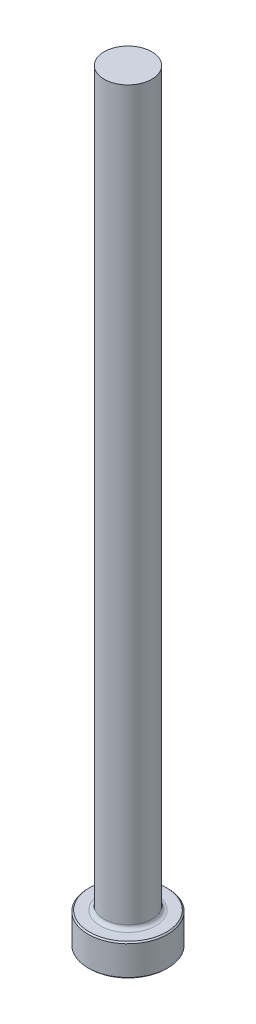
from build123d import *

# Parameters (mm, degrees)
CHAMFER1_SIZE = 0.254
FILLET1_R     = 0.762


with BuildPart() as part:
    # Sketch1 → Revolve1 (revolve)
    with BuildSketch(Plane.XY, mode=Mode.PRIVATE) as revolve1_sk:
        Polygon((0, 0), (-7.9375, 0), (-7.9375, 6.35), (-4.7625, 6.35), (-4.7625, 152.4), (0, 152.4), align=None)
    revolve(revolve1_sk.sketch.rotate(Axis((0, 259.958771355, 0), (0, -1, 0)), 270), axis=Axis((0, 259.958771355, 0), (0, -1, 0)))

    # Chamfer1
    chamfer1_edges = [part.edges().sort_by_distance(p)[0] for p in [
        (0, 6.35, -7.9375),
        (0, 0, -7.9375),
    ]]
    chamfer(chamfer1_edges, length=CHAMFER1_SIZE)

    # Fillet1
    fillet1_edges = [part.edges().sort_by_distance(p)[0] for p in [
        (0, 6.35, -4.7625),
    ]]
    fillet(fillet1_edges, radius=FILLET1_R)


solid = part.part
